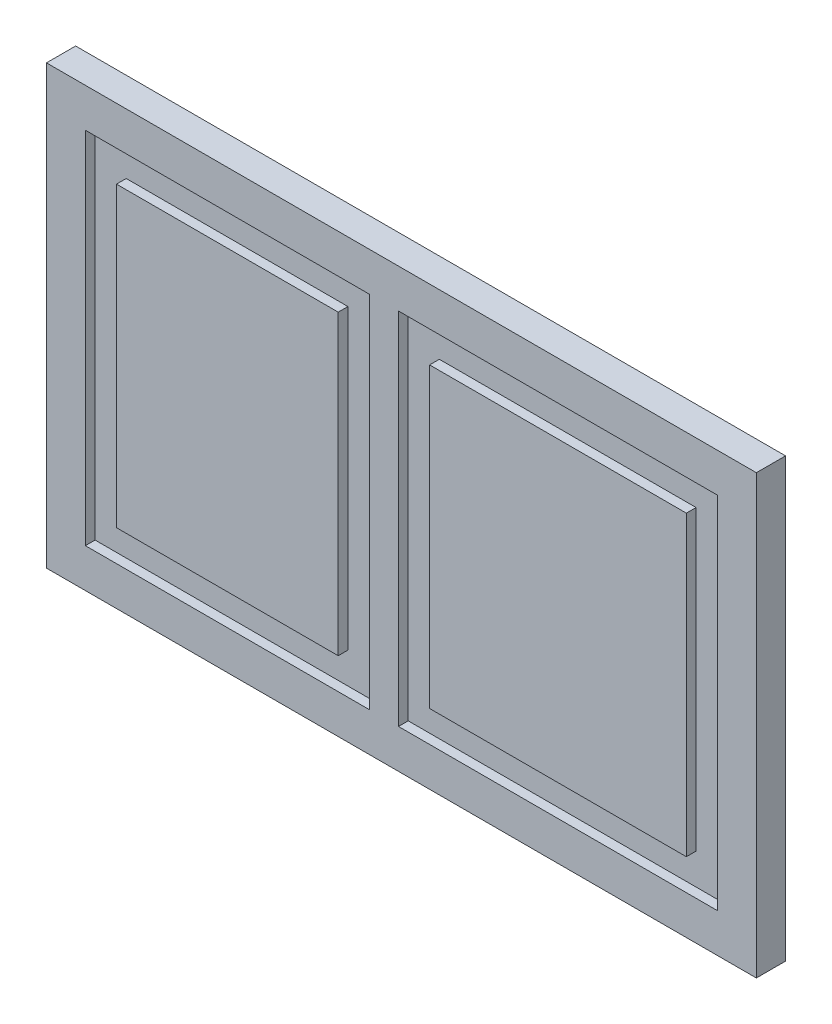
from build123d import *

# Parameters (mm, degrees)
ESQUISSE1_W             = 73
ESQUISSE1_H             = 45
EXTRUSION1_DEPTH        = 3
ESQUISSE2_W             = 29.2
ESQUISSE2_H             = 37
ESQUISSE2_W_2           = 22.8
ESQUISSE2_H_2           = 30.6
ESQUISSE2_W_3           = 32.8
ESQUISSE2_W_4           = 26.4
ENL_V_MAT_EXTRU_1_DEPTH = 1


with BuildPart() as part:
    # Esquisse1 → Extrusion1 (new body)
    with BuildSketch(Plane.XY):
        with Locations((6.5, 17.5)):
            Rectangle(ESQUISSE1_W, ESQUISSE1_H)
    extrude(amount=EXTRUSION1_DEPTH)

    # Esquisse2 → Enl_v. mat.-Extru.1 (cut)
    # profile 1 of 2: a face of its own
    with BuildSketch(Plane.XY.offset(3)):
        with Locations((-11.4, 17.5)):
            Rectangle(ESQUISSE2_W, ESQUISSE2_H)
        with Locations((-11.4, 17.5)):
            Rectangle(ESQUISSE2_W_2, ESQUISSE2_H_2, mode=Mode.SUBTRACT)
    # profile 2 of 2: a face of its own
    with BuildSketch(Plane.XY.offset(3)):
        with Locations((22.6, 17.5)):
            Rectangle(ESQUISSE2_W_3, ESQUISSE2_H)
        with Locations((22.6, 17.5)):
            Rectangle(ESQUISSE2_W_4, ESQUISSE2_H_2, mode=Mode.SUBTRACT)
    extrude(amount=-ENL_V_MAT_EXTRU_1_DEPTH, mode=Mode.SUBTRACT)


solid = part.part
